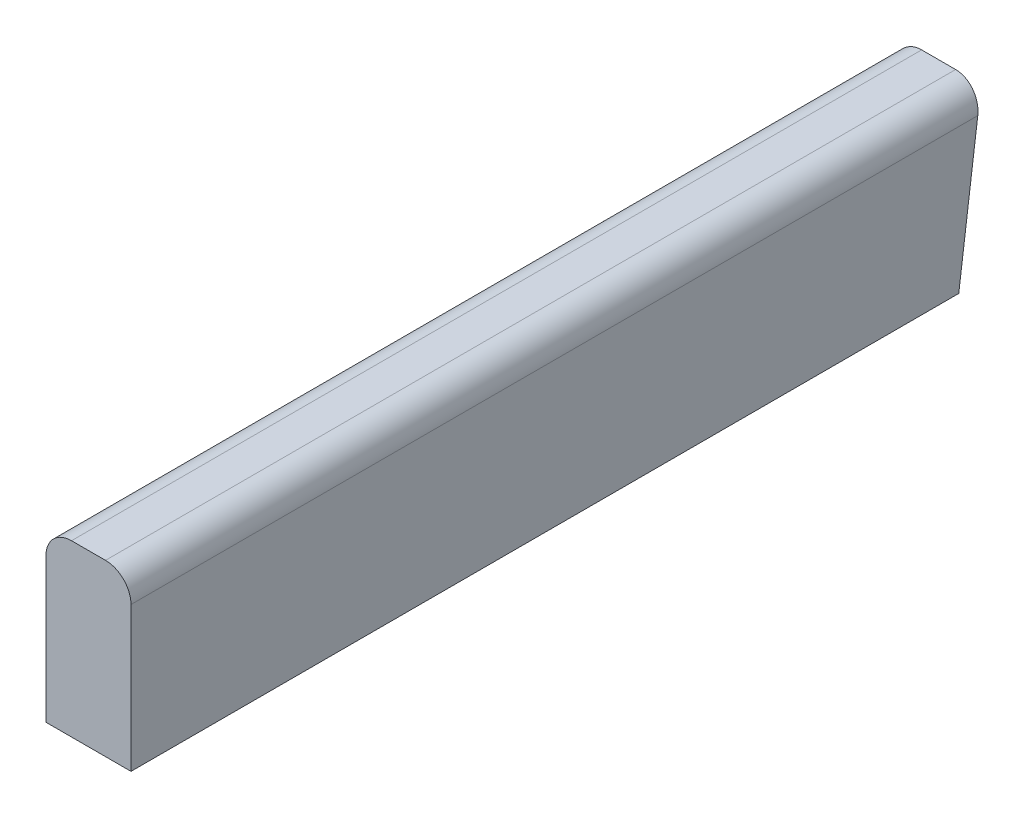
from build123d import *

# Parameters (mm, degrees)
LINEAR_AUSTRAGEN1_DEPTH         = 100
SCHNITT_LINEAR_AUSTRAGEN1_DEPTH = 103.46950766


with BuildPart() as part:
    # Skizze1 → Linear austragen1 (new body)
    with BuildSketch(Plane.XY):
        with BuildLine():
            Line((0, 0), (10, 0))
            Line((10, 0), (10, 17))
            ThreePointArc((10, 17), (9.121320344, 19.121320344), (7, 20))
            Line((7, 20), (3, 20))
            ThreePointArc((3, 20), (0.878679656, 19.121320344), (0, 17))
            Line((0, 17), (0, 0))
        make_face()
    extrude(amount=LINEAR_AUSTRAGEN1_DEPTH)

    # Skizze2 → Schnitt-Linear austragen1 (cut, through all)
    with BuildSketch(Plane(origin=(10, 0, 0), x_dir=(0, 0, -1), z_dir=(1, 0, 0))):
        Polygon((0, 20), (-2.633049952, 0), (0, 0), align=None)
    extrude(amount=-SCHNITT_LINEAR_AUSTRAGEN1_DEPTH, mode=Mode.SUBTRACT)


solid = part.part
